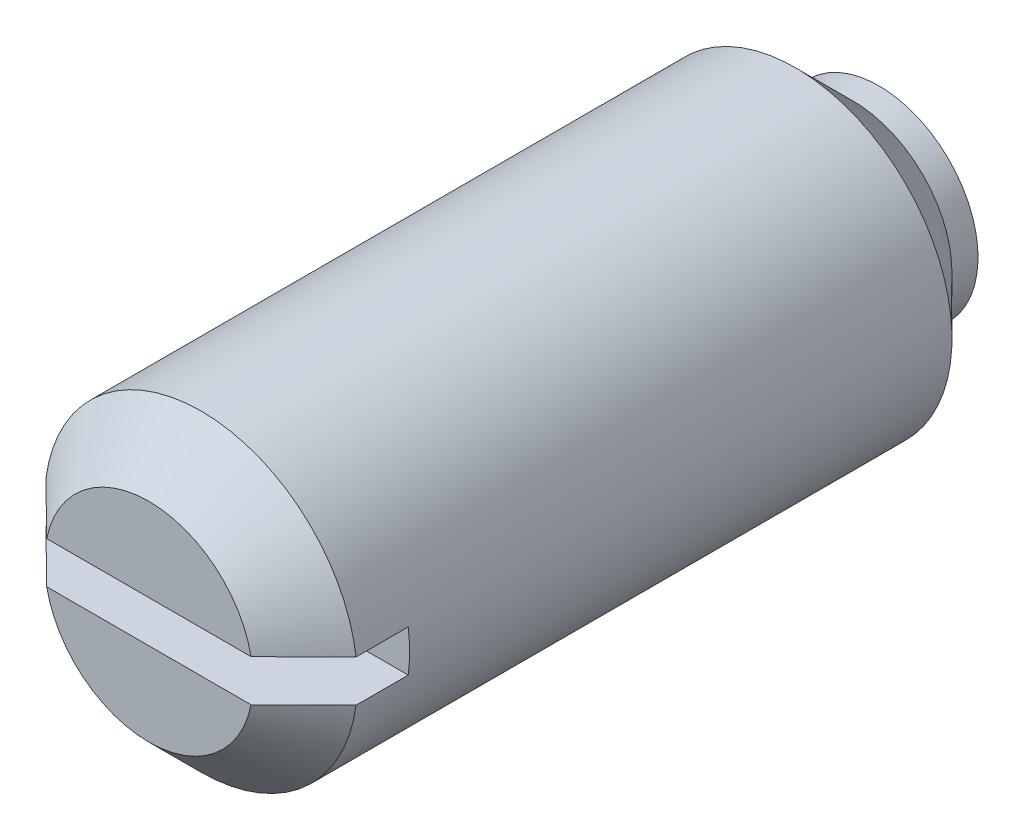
ISO-10303-21;
HEADER;
FILE_DESCRIPTION(('STEP AP214'),'2;1');
FILE_NAME('part.step','',(''),(''),'','','');
FILE_SCHEMA(('AUTOMOTIVE_DESIGN { 1 0 10303 214 1 1 1 1 }'));
ENDSEC;
DATA;
#1=APPLICATION_CONTEXT('core data for automotive mechanical design processes');
#2=APPLICATION_PROTOCOL_DEFINITION('international standard','automotive_design',2000,#1);
#3=PRODUCT_CONTEXT('',#1,'mechanical');
#4=PRODUCT('Part','Part','',(#3));
#5=PRODUCT_RELATED_PRODUCT_CATEGORY('part','',(#4));
#6=PRODUCT_DEFINITION_FORMATION('','',#4);
#7=PRODUCT_DEFINITION_CONTEXT('part definition',#1,'design');
#8=PRODUCT_DEFINITION('design','',#6,#7);
#9=PRODUCT_DEFINITION_SHAPE('','',#8);
#10=(LENGTH_UNIT() NAMED_UNIT(*) SI_UNIT(.MILLI.,.METRE.));
#11=(NAMED_UNIT(*) PLANE_ANGLE_UNIT() SI_UNIT($,.RADIAN.));
#12=(NAMED_UNIT(*) SI_UNIT($,.STERADIAN.) SOLID_ANGLE_UNIT());
#13=UNCERTAINTY_MEASURE_WITH_UNIT(LENGTH_MEASURE(1.E-05),#10,'distance_accuracy_value','');
#14=(GEOMETRIC_REPRESENTATION_CONTEXT(3) GLOBAL_UNCERTAINTY_ASSIGNED_CONTEXT((#13)) GLOBAL_UNIT_ASSIGNED_CONTEXT((#10,
#11,#12)) REPRESENTATION_CONTEXT('',''));
#15=CARTESIAN_POINT('',(0.,0.,0.));
#16=DIRECTION('',(0.,0.,1.));
#17=DIRECTION('',(1.,0.,0.));
#18=AXIS2_PLACEMENT_3D('',#15,#16,#17);
#19=CARTESIAN_POINT('',(0.,-1.5,7.5));
#20=DIRECTION('',(0.,0.,1.));
#21=DIRECTION('',(-1.,0.,0.));
#22=AXIS2_PLACEMENT_3D('',#19,#20,#21);
#23=PLANE('',#22);
#24=CARTESIAN_POINT('',(0.,0.,7.5));
#25=DIRECTION('',(0.,0.,-1.));
#26=DIRECTION('',(0.,-1.,0.));
#27=AXIS2_PLACEMENT_3D('',#24,#25,#26);
#28=CIRCLE('',#27,1.);
#29=CARTESIAN_POINT('',(0.979795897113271,-0.2,7.5));
#30=VERTEX_POINT('',#29);
#31=CARTESIAN_POINT('',(-0.979795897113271,-0.2,7.5));
#32=VERTEX_POINT('',#31);
#33=EDGE_CURVE('E35',#30,#32,#28,.T.);
#34=ORIENTED_EDGE('',*,*,#33,.F.);
#35=DIRECTION('',(-1.,0.,0.));
#36=VECTOR('',#35,1.);
#37=CARTESIAN_POINT('',(1.48660687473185,-0.2,7.5));
#38=LINE('',#37,#36);
#39=EDGE_CURVE('E124',#30,#32,#38,.T.);
#40=ORIENTED_EDGE('',*,*,#39,.T.);
#41=EDGE_LOOP('',(#34,#40));
#42=FACE_BOUND('',#41,.T.);
#43=ADVANCED_FACE('F14',(#42),#23,.T.);
#44=CARTESIAN_POINT('',(0.,0.,-12.5));
#45=DIRECTION('',(0.,0.,-1.));
#46=DIRECTION('',(1.,0.,0.));
#47=AXIS2_PLACEMENT_3D('',#44,#45,#46);
#48=CYLINDRICAL_SURFACE('',#47,1.5);
#49=CARTESIAN_POINT('',(0.,0.,7.));
#50=DIRECTION('',(0.,0.,-1.));
#51=DIRECTION('',(0.,-1.,0.));
#52=AXIS2_PLACEMENT_3D('',#49,#50,#51);
#53=CIRCLE('',#52,1.5);
#54=CARTESIAN_POINT('',(-1.48660687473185,0.2,7.));
#55=VERTEX_POINT('',#54);
#56=CARTESIAN_POINT('',(1.48660687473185,0.2,7.));
#57=VERTEX_POINT('',#56);
#58=EDGE_CURVE('E43',#55,#57,#53,.T.);
#59=ORIENTED_EDGE('',*,*,#58,.T.);
#60=DIRECTION('',(0.,0.,1.));
#61=VECTOR('',#60,1.);
#62=CARTESIAN_POINT('',(1.48660687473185,0.2,6.5));
#63=LINE('',#62,#61);
#64=CARTESIAN_POINT('',(1.48660687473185,0.2,6.5));
#65=VERTEX_POINT('',#64);
#66=EDGE_CURVE('E101',#65,#57,#63,.T.);
#67=ORIENTED_EDGE('',*,*,#66,.F.);
#68=CARTESIAN_POINT('',(0.,0.,6.5));
#69=DIRECTION('',(0.,0.,1.));
#70=DIRECTION('',(-1.,0.,0.));
#71=AXIS2_PLACEMENT_3D('',#68,#69,#70);
#72=CIRCLE('',#71,1.5);
#73=CARTESIAN_POINT('',(1.48660687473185,-0.2,6.5));
#74=VERTEX_POINT('',#73);
#75=EDGE_CURVE('E121',#74,#65,#72,.T.);
#76=ORIENTED_EDGE('',*,*,#75,.F.);
#77=DIRECTION('',(0.,0.,1.));
#78=VECTOR('',#77,1.);
#79=CARTESIAN_POINT('',(1.48660687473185,-0.2,6.5));
#80=LINE('',#79,#78);
#81=CARTESIAN_POINT('',(1.48660687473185,-0.2,7.));
#82=VERTEX_POINT('',#81);
#83=EDGE_CURVE('E89',#74,#82,#80,.T.);
#84=ORIENTED_EDGE('',*,*,#83,.T.);
#85=CARTESIAN_POINT('',(-1.48660687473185,-0.2,7.));
#86=VERTEX_POINT('',#85);
#87=EDGE_CURVE('E73',#82,#86,#53,.T.);
#88=ORIENTED_EDGE('',*,*,#87,.T.);
#89=DIRECTION('',(0.,0.,1.));
#90=VECTOR('',#89,1.);
#91=CARTESIAN_POINT('',(-1.48660687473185,-0.2,6.5));
#92=LINE('',#91,#90);
#93=CARTESIAN_POINT('',(-1.48660687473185,-0.2,6.5));
#94=VERTEX_POINT('',#93);
#95=EDGE_CURVE('E87',#94,#86,#92,.T.);
#96=ORIENTED_EDGE('',*,*,#95,.F.);
#97=CARTESIAN_POINT('',(-1.48660687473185,0.2,6.5));
#98=VERTEX_POINT('',#97);
#99=EDGE_CURVE('E117',#98,#94,#72,.T.);
#100=ORIENTED_EDGE('',*,*,#99,.F.);
#101=DIRECTION('',(0.,0.,1.));
#102=VECTOR('',#101,1.);
#103=CARTESIAN_POINT('',(-1.48660687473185,0.2,6.5));
#104=LINE('',#103,#102);
#105=EDGE_CURVE('E96',#98,#55,#104,.T.);
#106=ORIENTED_EDGE('',*,*,#105,.T.);
#107=EDGE_LOOP('',(#59,#67,#76,#84,#88,#96,#100,#106));
#108=FACE_BOUND('',#107,.T.);
#109=CARTESIAN_POINT('',(0.,0.,1.3));
#110=DIRECTION('',(0.,0.,-1.));
#111=DIRECTION('',(-1.,0.,0.));
#112=AXIS2_PLACEMENT_3D('',#109,#110,#111);
#113=CIRCLE('',#112,1.5);
#114=CARTESIAN_POINT('',(-1.5,0.,1.3));
#115=VERTEX_POINT('',#114);
#116=EDGE_CURVE('E174',#115,#115,#113,.T.);
#117=ORIENTED_EDGE('',*,*,#116,.F.);
#118=EDGE_LOOP('',(#117));
#119=FACE_BOUND('',#118,.T.);
#120=ADVANCED_FACE('F84',(#108,#119),#48,.T.);
#121=CARTESIAN_POINT('',(-0.979795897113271,0.2,7.5));
#122=VERTEX_POINT('',#121);
#123=CARTESIAN_POINT('',(0.979795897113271,0.2,7.5));
#124=VERTEX_POINT('',#123);
#125=EDGE_CURVE('E90',#122,#124,#28,.T.);
#126=ORIENTED_EDGE('',*,*,#125,.F.);
#127=DIRECTION('',(-1.,0.,0.));
#128=VECTOR('',#127,1.);
#129=CARTESIAN_POINT('',(1.48660687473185,0.2,7.5));
#130=LINE('',#129,#128);
#131=EDGE_CURVE('E114',#124,#122,#130,.T.);
#132=ORIENTED_EDGE('',*,*,#131,.F.);
#133=EDGE_LOOP('',(#126,#132));
#134=FACE_BOUND('',#133,.T.);
#135=ADVANCED_FACE('F154',(#134),#23,.T.);
#136=CARTESIAN_POINT('',(1.48660687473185,-0.2,6.5));
#137=DIRECTION('',(0.,1.,0.));
#138=DIRECTION('',(-1.,0.,0.));
#139=AXIS2_PLACEMENT_3D('',#136,#137,#138);
#140=PLANE('',#139);
#141=CARTESIAN_POINT('',(3.29578448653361,-0.2,5.19815273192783));
#142=CARTESIAN_POINT('',(3.1833435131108,-0.2,5.31038560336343));
#143=CARTESIAN_POINT('',(3.0708935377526,-0.2,5.42260946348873));
#144=CARTESIAN_POINT('',(2.84596245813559,-0.2,5.64702925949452));
#145=CARTESIAN_POINT('',(2.73348135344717,-0.2,5.75922519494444));
#146=CARTESIAN_POINT('',(2.50844128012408,-0.2,5.98361274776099));
#147=CARTESIAN_POINT('',(2.39588229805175,-0.2,6.0958043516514));
#148=CARTESIAN_POINT('',(2.170704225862,-0.2,6.32012404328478));
#149=CARTESIAN_POINT('',(2.05808513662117,-0.2,6.4322521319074));
#150=CARTESIAN_POINT('',(1.82950691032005,-0.2,6.65963171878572));
#151=CARTESIAN_POINT('',(1.71354486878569,-0.2,6.77488029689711));
#152=CARTESIAN_POINT('',(1.48143383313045,-0.2,7.0051990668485));
#153=CARTESIAN_POINT('',(1.36528483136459,-0.2,7.12026925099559));
#154=CARTESIAN_POINT('',(1.19078476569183,-0.2,7.29257008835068));
#155=CARTESIAN_POINT('',(1.13257810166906,-0.2,7.34994696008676));
#156=CARTESIAN_POINT('',(1.01601139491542,-0.2,7.46454696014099));
#157=CARTESIAN_POINT('',(0.95765134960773,-0.2,7.52177008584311));
#158=CARTESIAN_POINT('',(0.840680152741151,-0.2,7.63594975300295));
#159=CARTESIAN_POINT('',(0.782069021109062,-0.2,7.69290631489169));
#160=CARTESIAN_POINT('',(0.664390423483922,-0.2,7.80634556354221));
#161=CARTESIAN_POINT('',(0.605322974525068,-0.2,7.86282826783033));
#162=CARTESIAN_POINT('',(0.529685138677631,-0.2,7.93383952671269));
#163=CARTESIAN_POINT('',(0.51359115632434,-0.2,7.94887440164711));
#164=CARTESIAN_POINT('',(0.48130059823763,-0.2,7.9788338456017));
#165=CARTESIAN_POINT('',(0.465104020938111,-0.2,7.99375841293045));
#166=CARTESIAN_POINT('',(0.416406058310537,-0.2,8.03824792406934));
#167=CARTESIAN_POINT('',(0.383714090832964,-0.2,8.067606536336));
#168=CARTESIAN_POINT('',(0.329346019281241,-0.2,8.11482510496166));
#169=CARTESIAN_POINT('',(0.307954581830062,-0.2,8.13300930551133));
#170=CARTESIAN_POINT('',(0.264440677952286,-0.2,8.16868107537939));
#171=CARTESIAN_POINT('',(0.242315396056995,-0.2,8.18616520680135));
#172=CARTESIAN_POINT('',(0.196727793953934,-0.2,8.21989984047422));
#173=CARTESIAN_POINT('',(0.173253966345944,-0.2,8.23613563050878));
#174=CARTESIAN_POINT('',(0.136604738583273,-0.2,8.25799051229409));
#175=CARTESIAN_POINT('',(0.124181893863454,-0.2,8.26484475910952));
#176=CARTESIAN_POINT('',(0.0987113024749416,-0.2,8.27724544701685));
#177=CARTESIAN_POINT('',(0.0856649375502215,-0.2,8.28279463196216));
#178=CARTESIAN_POINT('',(0.0589107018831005,-0.2,8.29187949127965));
#179=CARTESIAN_POINT('',(0.0452058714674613,-0.2,8.29542360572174));
#180=CARTESIAN_POINT('',(0.0174102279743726,-0.2,8.29970512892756));
#181=CARTESIAN_POINT('',(0.00332212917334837,-0.2,8.30045877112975));
#182=CARTESIAN_POINT('',(-0.0246813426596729,-0.2,8.29897136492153));
#183=CARTESIAN_POINT('',(-0.0385967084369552,-0.2,8.29673019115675));
#184=CARTESIAN_POINT('',(-0.0658732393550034,-0.2,8.28985242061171));
#185=CARTESIAN_POINT('',(-0.0792301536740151,-0.2,8.28520015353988));
#186=CARTESIAN_POINT('',(-0.108946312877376,-0.2,8.27276086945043));
#187=CARTESIAN_POINT('',(-0.125080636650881,-0.2,8.2644587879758));
#188=CARTESIAN_POINT('',(-0.156507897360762,-0.2,8.24636628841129));
#189=CARTESIAN_POINT('',(-0.17179847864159,-0.2,8.23657196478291));
#190=CARTESIAN_POINT('',(-0.201882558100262,-0.2,8.21603647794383));
#191=CARTESIAN_POINT('',(-0.216671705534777,-0.2,8.20528902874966));
#192=CARTESIAN_POINT('',(-0.245803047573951,-0.2,8.18325133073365));
#193=CARTESIAN_POINT('',(-0.260145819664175,-0.2,8.17196183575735));
#194=CARTESIAN_POINT('',(-0.307408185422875,-0.2,8.13378663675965));
#195=CARTESIAN_POINT('',(-0.339685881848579,-0.2,8.10611184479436));
#196=CARTESIAN_POINT('',(-0.403488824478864,-0.2,8.04990435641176));
#197=CARTESIAN_POINT('',(-0.435013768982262,-0.2,8.02137132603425));
#198=CARTESIAN_POINT('',(-0.497668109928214,-0.2,7.96379100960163));
#199=CARTESIAN_POINT('',(-0.528796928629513,-0.2,7.93474309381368));
#200=CARTESIAN_POINT('',(-0.59078068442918,-0.2,7.87636917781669));
#201=CARTESIAN_POINT('',(-0.621635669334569,-0.2,7.84704322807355));
#202=CARTESIAN_POINT('',(-0.713543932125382,-0.2,7.75917806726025));
#203=CARTESIAN_POINT('',(-0.774344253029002,-0.2,7.70037445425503));
#204=CARTESIAN_POINT('',(-0.895574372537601,-0.2,7.58246853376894));
#205=CARTESIAN_POINT('',(-0.956004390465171,-0.2,7.52336645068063));
#206=CARTESIAN_POINT('',(-1.11142135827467,-0.2,7.37087982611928));
#207=CARTESIAN_POINT('',(-1.20626849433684,-0.2,7.27735278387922));
#208=CARTESIAN_POINT('',(-1.39574021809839,-0.2,7.09007255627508));
#209=CARTESIAN_POINT('',(-1.49036480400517,-0.2,6.99631936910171));
#210=CARTESIAN_POINT('',(-1.77410964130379,-0.2,6.71481535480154));
#211=CARTESIAN_POINT('',(-1.96304356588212,-0.2,6.52687672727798));
#212=CARTESIAN_POINT('',(-2.34270279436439,-0.2,6.1488369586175));
#213=CARTESIAN_POINT('',(-2.5334260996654,-0.2,5.95873381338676));
#214=CARTESIAN_POINT('',(-2.91469946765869,-0.2,5.57847640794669));
#215=CARTESIAN_POINT('',(-3.10524956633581,-0.2,5.38832218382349));
#216=CARTESIAN_POINT('',(-3.29578448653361,-0.2,5.19815273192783));
#217=B_SPLINE_CURVE_WITH_KNOTS('',3,(#141,#142,#143,#144,#145,#146,#147,#148,#149,#150,#151,
#152,#153,#154,#155,#156,#157,#158,#159,#160,#161,#162,#163,#164,#165,#166,#167,#168,#169,#170,
#171,#172,#173,#174,#175,#176,#177,#178,#179,#180,#181,#182,#183,#184,#185,#186,#187,#188,#189,
#190,#191,#192,#193,#194,#195,#196,#197,#198,#199,#200,#201,#202,#203,#204,#205,#206,#207,#208,
#209,#210,#211,#212,#213,#214,#215,#216),.UNSPECIFIED.,.F.,.F.,(4,2,2,2,2,2,2,2,2,2,2,2,2,2,2,2,
2,2,2,2,2,2,2,2,2,2,2,2,2,2,2,2,2,2,2,2,2,4),(0.,0.476605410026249,0.953217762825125,
1.4299863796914,1.90674822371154,2.39722231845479,2.88771700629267,3.13291293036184,
3.37811300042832,3.62329395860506,3.86846580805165,3.93453776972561,4.00061074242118,
4.13241671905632,4.21663086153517,4.30121757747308,4.38668353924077,4.42920139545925,
4.47162904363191,4.51387674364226,4.55587828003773,4.59788157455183,4.64016134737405,
4.69445104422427,4.74888535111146,4.80370999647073,4.85846048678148,4.98596793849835,
5.11352566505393,5.24125195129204,5.36895548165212,5.62270531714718,5.87628657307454,
6.27589718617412,6.67551100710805,7.47498060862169,8.28283659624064,9.09043284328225),.UNSPECIFIED.);
#218=EDGE_CURVE('E79',#82,#30,#217,.T.);
#219=ORIENTED_EDGE('',*,*,#218,.F.);
#220=ORIENTED_EDGE('',*,*,#83,.F.);
#221=DIRECTION('',(-1.,0.,0.));
#222=VECTOR('',#221,1.);
#223=CARTESIAN_POINT('',(1.48660687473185,-0.2,6.5));
#224=LINE('',#223,#222);
#225=EDGE_CURVE('E95',#74,#94,#224,.T.);
#226=ORIENTED_EDGE('',*,*,#225,.T.);
#227=ORIENTED_EDGE('',*,*,#95,.T.);
#228=EDGE_CURVE('E70',#32,#86,#217,.T.);
#229=ORIENTED_EDGE('',*,*,#228,.F.);
#230=ORIENTED_EDGE('',*,*,#39,.F.);
#231=EDGE_LOOP('',(#219,#220,#226,#227,#229,#230));
#232=FACE_BOUND('',#231,.T.);
#233=ADVANCED_FACE('F93',(#232),#140,.T.);
#234=CARTESIAN_POINT('',(1.48660687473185,0.2,6.5));
#235=DIRECTION('',(0.,1.,0.));
#236=DIRECTION('',(-1.,0.,0.));
#237=AXIS2_PLACEMENT_3D('',#234,#235,#236);
#238=PLANE('',#237);
#239=ORIENTED_EDGE('',*,*,#66,.T.);
#240=CARTESIAN_POINT('',(3.29578448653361,0.2,5.19815273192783));
#241=CARTESIAN_POINT('',(3.1833435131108,0.2,5.31038560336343));
#242=CARTESIAN_POINT('',(3.0708935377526,0.2,5.42260946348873));
#243=CARTESIAN_POINT('',(2.84596245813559,0.2,5.64702925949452));
#244=CARTESIAN_POINT('',(2.73348135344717,0.2,5.75922519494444));
#245=CARTESIAN_POINT('',(2.50844128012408,0.2,5.98361274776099));
#246=CARTESIAN_POINT('',(2.39588229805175,0.2,6.0958043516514));
#247=CARTESIAN_POINT('',(2.170704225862,0.2,6.32012404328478));
#248=CARTESIAN_POINT('',(2.05808513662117,0.2,6.4322521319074));
#249=CARTESIAN_POINT('',(1.82950691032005,0.2,6.65963171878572));
#250=CARTESIAN_POINT('',(1.71354486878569,0.2,6.77488029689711));
#251=CARTESIAN_POINT('',(1.48143383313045,0.2,7.0051990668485));
#252=CARTESIAN_POINT('',(1.36528483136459,0.2,7.12026925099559));
#253=CARTESIAN_POINT('',(1.19078476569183,0.2,7.29257008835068));
#254=CARTESIAN_POINT('',(1.13257810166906,0.2,7.34994696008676));
#255=CARTESIAN_POINT('',(1.01601139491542,0.2,7.46454696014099));
#256=CARTESIAN_POINT('',(0.95765134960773,0.2,7.52177008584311));
#257=CARTESIAN_POINT('',(0.840680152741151,0.2,7.63594975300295));
#258=CARTESIAN_POINT('',(0.782069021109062,0.2,7.69290631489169));
#259=CARTESIAN_POINT('',(0.664390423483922,0.2,7.80634556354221));
#260=CARTESIAN_POINT('',(0.605322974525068,0.2,7.86282826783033));
#261=CARTESIAN_POINT('',(0.529685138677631,0.2,7.93383952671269));
#262=CARTESIAN_POINT('',(0.51359115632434,0.2,7.94887440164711));
#263=CARTESIAN_POINT('',(0.48130059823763,0.2,7.9788338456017));
#264=CARTESIAN_POINT('',(0.465104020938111,0.2,7.99375841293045));
#265=CARTESIAN_POINT('',(0.416406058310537,0.2,8.03824792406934));
#266=CARTESIAN_POINT('',(0.383714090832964,0.2,8.067606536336));
#267=CARTESIAN_POINT('',(0.329346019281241,0.2,8.11482510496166));
#268=CARTESIAN_POINT('',(0.307954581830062,0.2,8.13300930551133));
#269=CARTESIAN_POINT('',(0.264440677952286,0.2,8.16868107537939));
#270=CARTESIAN_POINT('',(0.242315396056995,0.2,8.18616520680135));
#271=CARTESIAN_POINT('',(0.196727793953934,0.2,8.21989984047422));
#272=CARTESIAN_POINT('',(0.173253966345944,0.2,8.23613563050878));
#273=CARTESIAN_POINT('',(0.136604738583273,0.2,8.25799051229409));
#274=CARTESIAN_POINT('',(0.124181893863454,0.2,8.26484475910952));
#275=CARTESIAN_POINT('',(0.0987113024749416,0.2,8.27724544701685));
#276=CARTESIAN_POINT('',(0.0856649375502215,0.2,8.28279463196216));
#277=CARTESIAN_POINT('',(0.0589107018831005,0.2,8.29187949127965));
#278=CARTESIAN_POINT('',(0.0452058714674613,0.2,8.29542360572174));
#279=CARTESIAN_POINT('',(0.0174102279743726,0.2,8.29970512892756));
#280=CARTESIAN_POINT('',(0.00332212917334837,0.2,8.30045877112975));
#281=CARTESIAN_POINT('',(-0.0246813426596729,0.2,8.29897136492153));
#282=CARTESIAN_POINT('',(-0.0385967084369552,0.2,8.29673019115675));
#283=CARTESIAN_POINT('',(-0.0658732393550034,0.2,8.28985242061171));
#284=CARTESIAN_POINT('',(-0.0792301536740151,0.2,8.28520015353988));
#285=CARTESIAN_POINT('',(-0.108946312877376,0.2,8.27276086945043));
#286=CARTESIAN_POINT('',(-0.125080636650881,0.2,8.2644587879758));
#287=CARTESIAN_POINT('',(-0.156507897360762,0.2,8.24636628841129));
#288=CARTESIAN_POINT('',(-0.17179847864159,0.2,8.23657196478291));
#289=CARTESIAN_POINT('',(-0.201882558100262,0.2,8.21603647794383));
#290=CARTESIAN_POINT('',(-0.216671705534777,0.2,8.20528902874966));
#291=CARTESIAN_POINT('',(-0.245803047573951,0.2,8.18325133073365));
#292=CARTESIAN_POINT('',(-0.260145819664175,0.2,8.17196183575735));
#293=CARTESIAN_POINT('',(-0.307408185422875,0.2,8.13378663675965));
#294=CARTESIAN_POINT('',(-0.339685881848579,0.2,8.10611184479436));
#295=CARTESIAN_POINT('',(-0.403488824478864,0.2,8.04990435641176));
#296=CARTESIAN_POINT('',(-0.435013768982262,0.2,8.02137132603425));
#297=CARTESIAN_POINT('',(-0.497668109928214,0.2,7.96379100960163));
#298=CARTESIAN_POINT('',(-0.528796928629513,0.2,7.93474309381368));
#299=CARTESIAN_POINT('',(-0.59078068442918,0.2,7.87636917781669));
#300=CARTESIAN_POINT('',(-0.621635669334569,0.2,7.84704322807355));
#301=CARTESIAN_POINT('',(-0.713543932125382,0.2,7.75917806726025));
#302=CARTESIAN_POINT('',(-0.774344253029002,0.2,7.70037445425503));
#303=CARTESIAN_POINT('',(-0.895574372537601,0.2,7.58246853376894));
#304=CARTESIAN_POINT('',(-0.956004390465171,0.2,7.52336645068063));
#305=CARTESIAN_POINT('',(-1.11142135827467,0.2,7.37087982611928));
#306=CARTESIAN_POINT('',(-1.20626849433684,0.2,7.27735278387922));
#307=CARTESIAN_POINT('',(-1.39574021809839,0.2,7.09007255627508));
#308=CARTESIAN_POINT('',(-1.49036480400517,0.2,6.99631936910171));
#309=CARTESIAN_POINT('',(-1.77410964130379,0.2,6.71481535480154));
#310=CARTESIAN_POINT('',(-1.96304356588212,0.2,6.52687672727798));
#311=CARTESIAN_POINT('',(-2.34270279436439,0.2,6.1488369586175));
#312=CARTESIAN_POINT('',(-2.5334260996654,0.2,5.95873381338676));
#313=CARTESIAN_POINT('',(-2.91469946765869,0.2,5.57847640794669));
#314=CARTESIAN_POINT('',(-3.10524956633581,0.2,5.38832218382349));
#315=CARTESIAN_POINT('',(-3.29578448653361,0.2,5.19815273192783));
#316=B_SPLINE_CURVE_WITH_KNOTS('',3,(#240,#241,#242,#243,#244,#245,#246,#247,#248,#249,#250,
#251,#252,#253,#254,#255,#256,#257,#258,#259,#260,#261,#262,#263,#264,#265,#266,#267,#268,#269,
#270,#271,#272,#273,#274,#275,#276,#277,#278,#279,#280,#281,#282,#283,#284,#285,#286,#287,#288,
#289,#290,#291,#292,#293,#294,#295,#296,#297,#298,#299,#300,#301,#302,#303,#304,#305,#306,#307,
#308,#309,#310,#311,#312,#313,#314,#315),.UNSPECIFIED.,.F.,.F.,(4,2,2,2,2,2,2,2,2,2,2,2,2,2,2,2,
2,2,2,2,2,2,2,2,2,2,2,2,2,2,2,2,2,2,2,2,2,4),(0.,0.476605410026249,0.953217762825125,
1.4299863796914,1.90674822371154,2.39722231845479,2.88771700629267,3.13291293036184,
3.37811300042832,3.62329395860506,3.86846580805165,3.93453776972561,4.00061074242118,
4.13241671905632,4.21663086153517,4.30121757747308,4.38668353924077,4.42920139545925,
4.47162904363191,4.51387674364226,4.55587828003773,4.59788157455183,4.64016134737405,
4.69445104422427,4.74888535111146,4.80370999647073,4.85846048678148,4.98596793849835,
5.11352566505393,5.24125195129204,5.36895548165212,5.62270531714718,5.87628657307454,
6.27589718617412,6.67551100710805,7.47498060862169,8.28283659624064,9.09043284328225),.UNSPECIFIED.);
#317=EDGE_CURVE('E9',#57,#124,#316,.T.);
#318=ORIENTED_EDGE('',*,*,#317,.T.);
#319=ORIENTED_EDGE('',*,*,#131,.T.);
#320=EDGE_CURVE('E18',#122,#55,#316,.T.);
#321=ORIENTED_EDGE('',*,*,#320,.T.);
#322=ORIENTED_EDGE('',*,*,#105,.F.);
#323=DIRECTION('',(-1.,0.,0.));
#324=VECTOR('',#323,1.);
#325=CARTESIAN_POINT('',(1.48660687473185,0.2,6.5));
#326=LINE('',#325,#324);
#327=EDGE_CURVE('E119',#65,#98,#326,.T.);
#328=ORIENTED_EDGE('',*,*,#327,.F.);
#329=EDGE_LOOP('',(#239,#318,#319,#321,#322,#328));
#330=FACE_BOUND('',#329,.T.);
#331=ADVANCED_FACE('F111',(#330),#238,.F.);
#332=CARTESIAN_POINT('',(0.,0.,6.5));
#333=DIRECTION('',(0.,0.,1.));
#334=DIRECTION('',(-1.,0.,0.));
#335=AXIS2_PLACEMENT_3D('',#332,#333,#334);
#336=PLANE('',#335);
#337=ORIENTED_EDGE('',*,*,#75,.T.);
#338=ORIENTED_EDGE('',*,*,#327,.T.);
#339=ORIENTED_EDGE('',*,*,#99,.T.);
#340=ORIENTED_EDGE('',*,*,#225,.F.);
#341=EDGE_LOOP('',(#337,#338,#339,#340));
#342=FACE_BOUND('',#341,.T.);
#343=ADVANCED_FACE('F144',(#342),#336,.T.);
#344=CARTESIAN_POINT('',(0.,0.,7.5));
#345=DIRECTION('',(0.,0.,-1.));
#346=DIRECTION('',(0.,-1.,0.));
#347=AXIS2_PLACEMENT_3D('',#344,#345,#346);
#348=CONICAL_SURFACE('',#347,1.,0.785398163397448);
#349=ORIENTED_EDGE('',*,*,#58,.F.);
#350=ORIENTED_EDGE('',*,*,#320,.F.);
#351=ORIENTED_EDGE('',*,*,#125,.T.);
#352=ORIENTED_EDGE('',*,*,#317,.F.);
#353=EDGE_LOOP('',(#349,#350,#351,#352));
#354=FACE_BOUND('',#353,.T.);
#355=ADVANCED_FACE('F141',(#354),#348,.T.);
#356=ORIENTED_EDGE('',*,*,#218,.T.);
#357=ORIENTED_EDGE('',*,*,#33,.T.);
#358=ORIENTED_EDGE('',*,*,#228,.T.);
#359=ORIENTED_EDGE('',*,*,#87,.F.);
#360=EDGE_LOOP('',(#356,#357,#358,#359));
#361=FACE_BOUND('',#360,.T.);
#362=ADVANCED_FACE('F72',(#361),#348,.T.);
#363=CARTESIAN_POINT('',(0.,0.,0.75));
#364=DIRECTION('',(0.,0.,1.));
#365=DIRECTION('',(1.,0.,0.));
#366=AXIS2_PLACEMENT_3D('',#363,#364,#365);
#367=CONICAL_SURFACE('',#366,0.95,0.78539816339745);
#368=ORIENTED_EDGE('',*,*,#116,.T.);
#369=EDGE_LOOP('',(#368));
#370=FACE_BOUND('',#369,.T.);
#371=CARTESIAN_POINT('',(0.,0.,0.75));
#372=DIRECTION('',(0.,0.,-1.));
#373=DIRECTION('',(-1.,0.,0.));
#374=AXIS2_PLACEMENT_3D('',#371,#372,#373);
#375=CIRCLE('',#374,0.95);
#376=CARTESIAN_POINT('',(-0.95,0.,0.75));
#377=VERTEX_POINT('',#376);
#378=EDGE_CURVE('E171',#377,#377,#375,.T.);
#379=ORIENTED_EDGE('',*,*,#378,.F.);
#380=EDGE_LOOP('',(#379));
#381=FACE_BOUND('',#380,.T.);
#382=ADVANCED_FACE('F140',(#370,#381),#367,.T.);
#383=CARTESIAN_POINT('',(0.,0.,0.75));
#384=DIRECTION('',(1.,0.,0.));
#385=DIRECTION('',(0.,0.,1.));
#386=AXIS2_PLACEMENT_3D('',#383,#384,#385);
#387=SPHERICAL_SURFACE('',#386,0.75);
#388=CARTESIAN_POINT('',(0.,0.,0.75));
#389=DIRECTION('',(0.,0.,-1.));
#390=DIRECTION('',(1.,0.,0.));
#391=AXIS2_PLACEMENT_3D('',#388,#389,#390);
#392=SPHERICAL_SURFACE('',#391,0.75);
#393=CARTESIAN_POINT('',(0.,0.,0.5));
#394=DIRECTION('',(0.,0.,-1.));
#395=DIRECTION('',(1.,0.,0.));
#396=AXIS2_PLACEMENT_3D('',#393,#394,#395);
#397=CIRCLE('',#396,0.707106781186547);
#398=CARTESIAN_POINT('',(0.707106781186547,0.,0.5));
#399=VERTEX_POINT('',#398);
#400=EDGE_CURVE('E98',#399,#399,#397,.T.);
#401=ORIENTED_EDGE('',*,*,#400,.T.);
#402=EDGE_LOOP('',(#401));
#403=FACE_BOUND('',#402,.T.);
#404=ADVANCED_FACE('F16',(#403),#392,.T.);
#405=CARTESIAN_POINT('',(0.,-0.707106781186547,0.5));
#406=DIRECTION('',(0.,0.,-1.));
#407=DIRECTION('',(1.,0.,0.));
#408=AXIS2_PLACEMENT_3D('',#405,#406,#407);
#409=PLANE('',#408);
#410=CARTESIAN_POINT('',(0.,0.,0.5));
#411=DIRECTION('',(0.,0.,-1.));
#412=DIRECTION('',(0.,-1.,0.));
#413=AXIS2_PLACEMENT_3D('',#410,#411,#412);
#414=CIRCLE('',#413,0.95);
#415=CARTESIAN_POINT('',(0.,-0.95,0.5));
#416=VERTEX_POINT('',#415);
#417=EDGE_CURVE('E167',#416,#416,#414,.T.);
#418=ORIENTED_EDGE('',*,*,#417,.T.);
#419=EDGE_LOOP('',(#418));
#420=FACE_BOUND('',#419,.T.);
#421=ORIENTED_EDGE('',*,*,#400,.F.);
#422=EDGE_LOOP('',(#421));
#423=FACE_BOUND('',#422,.T.);
#424=ADVANCED_FACE('F184',(#420,#423),#409,.T.);
#425=CARTESIAN_POINT('',(0.,0.,-0.294617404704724));
#426=DIRECTION('',(0.,0.,-1.));
#427=DIRECTION('',(0.,-1.,0.));
#428=AXIS2_PLACEMENT_3D('',#425,#426,#427);
#429=CYLINDRICAL_SURFACE('',#428,0.95);
#430=ORIENTED_EDGE('',*,*,#378,.T.);
#431=EDGE_LOOP('',(#430));
#432=FACE_BOUND('',#431,.T.);
#433=ORIENTED_EDGE('',*,*,#417,.F.);
#434=EDGE_LOOP('',(#433));
#435=FACE_BOUND('',#434,.T.);
#436=ADVANCED_FACE('F142',(#432,#435),#429,.T.);
#437=CLOSED_SHELL('',(#43,#120,#135,#233,#331,#343,#355,#362,#382,#404,#424,#436));
#438=MANIFOLD_SOLID_BREP('B1',#437);
#439=ADVANCED_BREP_SHAPE_REPRESENTATION('',(#18,#438),#14);
#440=SHAPE_DEFINITION_REPRESENTATION(#9,#439);
ENDSEC;
END-ISO-10303-21;
